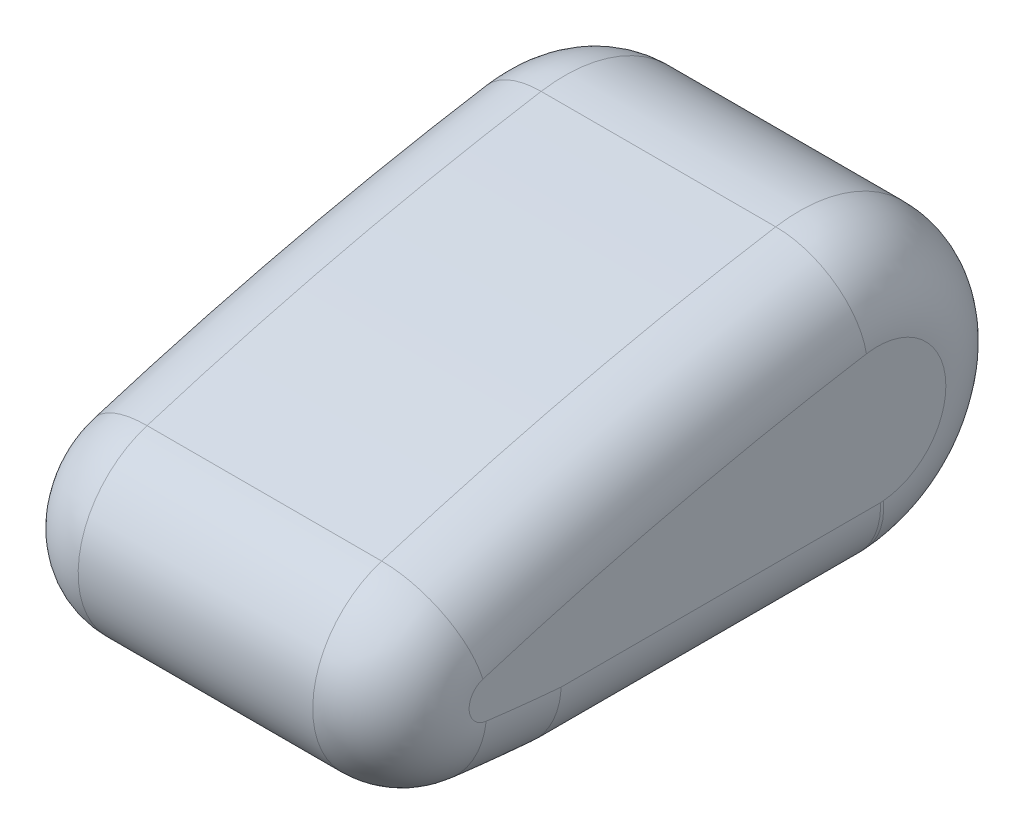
ISO-10303-21;
HEADER;
FILE_DESCRIPTION(('STEP AP214'),'2;1');
FILE_NAME('part.step','',(''),(''),'','','');
FILE_SCHEMA(('AUTOMOTIVE_DESIGN { 1 0 10303 214 1 1 1 1 }'));
ENDSEC;
DATA;
#1=APPLICATION_CONTEXT('core data for automotive mechanical design processes');
#2=APPLICATION_PROTOCOL_DEFINITION('international standard','automotive_design',2000,#1);
#3=PRODUCT_CONTEXT('',#1,'mechanical');
#4=PRODUCT('Part','Part','',(#3));
#5=PRODUCT_RELATED_PRODUCT_CATEGORY('part','',(#4));
#6=PRODUCT_DEFINITION_FORMATION('','',#4);
#7=PRODUCT_DEFINITION_CONTEXT('part definition',#1,'design');
#8=PRODUCT_DEFINITION('design','',#6,#7);
#9=PRODUCT_DEFINITION_SHAPE('','',#8);
#10=(LENGTH_UNIT() NAMED_UNIT(*) SI_UNIT(.MILLI.,.METRE.));
#11=(NAMED_UNIT(*) PLANE_ANGLE_UNIT() SI_UNIT($,.RADIAN.));
#12=(NAMED_UNIT(*) SI_UNIT($,.STERADIAN.) SOLID_ANGLE_UNIT());
#13=UNCERTAINTY_MEASURE_WITH_UNIT(LENGTH_MEASURE(1.E-05),#10,'distance_accuracy_value','');
#14=(GEOMETRIC_REPRESENTATION_CONTEXT(3) GLOBAL_UNCERTAINTY_ASSIGNED_CONTEXT((#13)) GLOBAL_UNIT_ASSIGNED_CONTEXT((#10,
#11,#12)) REPRESENTATION_CONTEXT('',''));
#15=CARTESIAN_POINT('',(0.,0.,0.));
#16=DIRECTION('',(0.,0.,1.));
#17=DIRECTION('',(1.,0.,0.));
#18=AXIS2_PLACEMENT_3D('',#15,#16,#17);
#19=CARTESIAN_POINT('',(-63.5,-1937.01800195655,-32.1917739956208));
#20=DIRECTION('',(-1.,0.,0.));
#21=DIRECTION('',(0.,0.,-1.));
#22=AXIS2_PLACEMENT_3D('',#19,#20,#21);
#23=CYLINDRICAL_SURFACE('',#22,762.);
#24=DIRECTION('',(-1.,0.,0.));
#25=VECTOR('',#24,1.);
#26=CARTESIAN_POINT('',(-63.5,-1184.90959196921,90.1885333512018));
#27=LINE('',#26,#25);
#28=CARTESIAN_POINT('',(-83.82,-1184.90959196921,90.1885333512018));
#29=VERTEX_POINT('',#28);
#30=CARTESIAN_POINT('',(-144.78,-1184.90959196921,90.1885333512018));
#31=VERTEX_POINT('',#30);
#32=EDGE_CURVE('E161',#29,#31,#27,.T.);
#33=ORIENTED_EDGE('',*,*,#32,.T.);
#34=CARTESIAN_POINT('',(-144.78,-1937.01800195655,-32.1917739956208));
#35=DIRECTION('',(-1.,0.,0.));
#36=DIRECTION('',(0.,0.,1.));
#37=AXIS2_PLACEMENT_3D('',#34,#35,#36);
#38=CIRCLE('',#37,762.);
#39=CARTESIAN_POINT('',(-144.78,-1208.92940757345,192.599237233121));
#40=VERTEX_POINT('',#39);
#41=EDGE_CURVE('E42',#40,#31,#38,.T.);
#42=ORIENTED_EDGE('',*,*,#41,.F.);
#43=DIRECTION('',(-1.,0.,0.));
#44=VECTOR('',#43,1.);
#45=CARTESIAN_POINT('',(-63.5,-1208.92940757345,192.599237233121));
#46=LINE('',#45,#44);
#47=CARTESIAN_POINT('',(-83.82,-1208.92940757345,192.599237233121));
#48=VERTEX_POINT('',#47);
#49=EDGE_CURVE('E169',#48,#40,#46,.T.);
#50=ORIENTED_EDGE('',*,*,#49,.F.);
#51=CARTESIAN_POINT('',(-83.82,-1937.01800195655,-32.1917739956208));
#52=DIRECTION('',(-1.,0.,0.));
#53=DIRECTION('',(0.,0.,1.));
#54=AXIS2_PLACEMENT_3D('',#51,#52,#53);
#55=CIRCLE('',#54,762.);
#56=EDGE_CURVE('E11',#29,#48,#55,.F.);
#57=ORIENTED_EDGE('',*,*,#56,.F.);
#58=EDGE_LOOP('',(#33,#42,#50,#57));
#59=FACE_BOUND('',#58,.T.);
#60=ADVANCED_FACE('F33',(#59),#23,.T.);
#61=CARTESIAN_POINT('',(-63.5,-1222.51501246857,84.0695179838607));
#62=DIRECTION('',(-1.,0.,0.));
#63=DIRECTION('',(0.,0.,-1.));
#64=AXIS2_PLACEMENT_3D('',#61,#62,#63);
#65=CYLINDRICAL_SURFACE('',#64,38.0999999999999);
#66=DIRECTION('',(-1.,0.,0.));
#67=VECTOR('',#66,1.);
#68=CARTESIAN_POINT('',(-63.5,-1260.4716735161,80.7677181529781));
#69=LINE('',#68,#67);
#70=CARTESIAN_POINT('',(-83.82,-1260.4716735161,80.7677181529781));
#71=VERTEX_POINT('',#70);
#72=CARTESIAN_POINT('',(-144.78,-1260.4716735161,80.7677181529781));
#73=VERTEX_POINT('',#72);
#74=EDGE_CURVE('E152',#71,#73,#69,.T.);
#75=ORIENTED_EDGE('',*,*,#74,.T.);
#76=CARTESIAN_POINT('',(-144.78,-1222.51501246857,84.0695179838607));
#77=DIRECTION('',(-1.,0.,0.));
#78=DIRECTION('',(0.,0.,1.));
#79=AXIS2_PLACEMENT_3D('',#76,#77,#78);
#80=CIRCLE('',#79,38.0999999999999);
#81=EDGE_CURVE('E188',#31,#73,#80,.T.);
#82=ORIENTED_EDGE('',*,*,#81,.F.);
#83=ORIENTED_EDGE('',*,*,#32,.F.);
#84=CARTESIAN_POINT('',(-83.82,-1222.51501246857,84.0695179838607));
#85=DIRECTION('',(-1.,0.,0.));
#86=DIRECTION('',(0.,0.,1.));
#87=AXIS2_PLACEMENT_3D('',#84,#85,#86);
#88=CIRCLE('',#87,38.0999999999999);
#89=EDGE_CURVE('E190',#71,#29,#88,.F.);
#90=ORIENTED_EDGE('',*,*,#89,.F.);
#91=EDGE_LOOP('',(#75,#82,#83,#90));
#92=FACE_BOUND('',#91,.T.);
#93=ADVANCED_FACE('F236',(#92),#65,.T.);
#94=CARTESIAN_POINT('',(-63.5,-754.382859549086,124.791715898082));
#95=DIRECTION('',(-1.,0.,0.));
#96=DIRECTION('',(0.,0.,-1.));
#97=AXIS2_PLACEMENT_3D('',#94,#95,#96);
#98=CYLINDRICAL_SURFACE('',#97,508.);
#99=DIRECTION('',(-1.,0.,0.));
#100=VECTOR('',#99,1.);
#101=CARTESIAN_POINT('',(-63.5,-1260.61501246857,82.4477983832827));
#102=LINE('',#101,#100);
#103=CARTESIAN_POINT('',(-83.82,-1260.61501246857,82.4477983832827));
#104=VERTEX_POINT('',#103);
#105=CARTESIAN_POINT('',(-144.78,-1260.61501246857,82.4477983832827));
#106=VERTEX_POINT('',#105);
#107=EDGE_CURVE('E150',#104,#106,#102,.T.);
#108=ORIENTED_EDGE('',*,*,#107,.T.);
#109=CARTESIAN_POINT('',(-144.78,-754.382859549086,124.791715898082));
#110=DIRECTION('',(-1.,0.,0.));
#111=DIRECTION('',(0.,0.,1.));
#112=AXIS2_PLACEMENT_3D('',#109,#110,#111);
#113=CIRCLE('',#112,508.);
#114=EDGE_CURVE('E154',#73,#106,#113,.T.);
#115=ORIENTED_EDGE('',*,*,#114,.F.);
#116=ORIENTED_EDGE('',*,*,#74,.F.);
#117=CARTESIAN_POINT('',(-83.82,-754.382859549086,124.791715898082));
#118=DIRECTION('',(-1.,0.,0.));
#119=DIRECTION('',(0.,0.,1.));
#120=AXIS2_PLACEMENT_3D('',#117,#118,#119);
#121=CIRCLE('',#120,508.);
#122=EDGE_CURVE('E124',#104,#71,#121,.F.);
#123=ORIENTED_EDGE('',*,*,#122,.F.);
#124=EDGE_LOOP('',(#108,#115,#116,#123));
#125=FACE_BOUND('',#124,.T.);
#126=ADVANCED_FACE('F148',(#125),#98,.T.);
#127=CARTESIAN_POINT('',(-63.5,-1260.61501246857,167.135633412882));
#128=DIRECTION('',(0.,-1.,0.));
#129=DIRECTION('',(0.,0.,-1.));
#130=AXIS2_PLACEMENT_3D('',#127,#128,#129);
#131=PLANE('',#130);
#132=ORIENTED_EDGE('',*,*,#107,.F.);
#133=DIRECTION('',(0.,0.,-1.));
#134=VECTOR('',#133,1.);
#135=CARTESIAN_POINT('',(-83.82,-1260.61501246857,167.135633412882));
#136=LINE('',#135,#134);
#137=CARTESIAN_POINT('',(-83.82,-1260.61501246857,167.135633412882));
#138=VERTEX_POINT('',#137);
#139=EDGE_CURVE('E135',#138,#104,#136,.T.);
#140=ORIENTED_EDGE('',*,*,#139,.F.);
#141=DIRECTION('',(-1.,0.,0.));
#142=VECTOR('',#141,1.);
#143=CARTESIAN_POINT('',(-63.5,-1260.61501246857,167.135633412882));
#144=LINE('',#143,#142);
#145=CARTESIAN_POINT('',(-144.78,-1260.61501246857,167.135633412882));
#146=VERTEX_POINT('',#145);
#147=EDGE_CURVE('E159',#138,#146,#144,.T.);
#148=ORIENTED_EDGE('',*,*,#147,.T.);
#149=CARTESIAN_POINT('',(-144.78,-1260.61501246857,82.4477983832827));
#150=CARTESIAN_POINT('',(-144.885954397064,-1260.61501246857,82.4474811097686));
#151=CARTESIAN_POINT('',(-144.991468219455,-1260.61501246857,82.4577264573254));
#152=CARTESIAN_POINT('',(-145.197732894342,-1260.61501246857,82.4963266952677));
#153=CARTESIAN_POINT('',(-145.298528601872,-1260.61501246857,82.5244372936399));
#154=CARTESIAN_POINT('',(-145.523684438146,-1260.61501246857,82.6065581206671));
#155=CARTESIAN_POINT('',(-145.646097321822,-1260.61501246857,82.6657946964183));
#156=CARTESIAN_POINT('',(-145.880525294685,-1260.61501246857,82.8029243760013));
#157=CARTESIAN_POINT('',(-145.992473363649,-1260.61501246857,82.8809276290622));
#158=CARTESIAN_POINT('',(-146.289943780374,-1260.61501246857,83.1158598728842));
#159=CARTESIAN_POINT('',(-146.464303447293,-1260.61501246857,83.2867064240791));
#160=CARTESIAN_POINT('',(-146.788207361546,-1260.61501246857,83.6499750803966));
#161=CARTESIAN_POINT('',(-146.937694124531,-1260.61501246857,83.842445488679));
#162=CARTESIAN_POINT('',(-147.189513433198,-1260.61501246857,84.1997213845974));
#163=CARTESIAN_POINT('',(-147.295245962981,-1260.61501246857,84.3621664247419));
#164=CARTESIAN_POINT('',(-147.497210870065,-1260.61501246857,84.6928954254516));
#165=CARTESIAN_POINT('',(-147.593439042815,-1260.61501246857,84.8611819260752));
#166=CARTESIAN_POINT('',(-147.870832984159,-1260.61501246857,85.3729365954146));
#167=CARTESIAN_POINT('',(-148.0403182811,-1260.61501246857,85.7227143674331));
#168=CARTESIAN_POINT('',(-148.357991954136,-1260.61501246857,86.4339216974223));
#169=CARTESIAN_POINT('',(-148.506053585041,-1260.61501246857,86.7954062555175));
#170=CARTESIAN_POINT('',(-148.715242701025,-1260.61501246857,87.3422552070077));
#171=CARTESIAN_POINT('',(-148.782785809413,-1260.61501246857,87.525199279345));
#172=CARTESIAN_POINT('',(-148.914074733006,-1260.61501246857,87.8924398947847));
#173=CARTESIAN_POINT('',(-148.977820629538,-1260.61501246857,88.0767364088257));
#174=CARTESIAN_POINT('',(-149.175652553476,-1260.61501246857,88.6660292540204));
#175=CARTESIAN_POINT('',(-149.303358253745,-1260.61501246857,89.0731727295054));
#176=CARTESIAN_POINT('',(-149.545809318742,-1260.61501246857,89.891323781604));
#177=CARTESIAN_POINT('',(-149.660552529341,-1260.61501246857,90.3023319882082));
#178=CARTESIAN_POINT('',(-149.879305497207,-1260.61501246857,91.1274166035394));
#179=CARTESIAN_POINT('',(-149.983309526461,-1260.61501246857,91.5414945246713));
#180=CARTESIAN_POINT('',(-150.182119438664,-1260.61501246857,92.3718606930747));
#181=CARTESIAN_POINT('',(-150.276924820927,-1260.61501246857,92.7881490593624));
#182=CARTESIAN_POINT('',(-150.549871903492,-1260.61501246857,94.0416040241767));
#183=CARTESIAN_POINT('',(-150.716035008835,-1260.61501246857,94.8813854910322));
#184=CARTESIAN_POINT('',(-151.023282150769,-1260.61501246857,96.565174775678));
#185=CARTESIAN_POINT('',(-151.164373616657,-1260.61501246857,97.4091812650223));
#186=CARTESIAN_POINT('',(-151.425918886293,-1260.61501246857,99.1004061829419));
#187=CARTESIAN_POINT('',(-151.54637171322,-1260.61501246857,99.9476247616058));
#188=CARTESIAN_POINT('',(-151.769703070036,-1260.61501246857,101.644415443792));
#189=CARTESIAN_POINT('',(-151.872580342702,-1260.61501246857,102.493987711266));
#190=CARTESIAN_POINT('',(-152.062824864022,-1260.61501246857,104.193706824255));
#191=CARTESIAN_POINT('',(-152.150212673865,-1260.61501246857,105.043851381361));
#192=CARTESIAN_POINT('',(-152.311259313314,-1260.61501246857,106.745445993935));
#193=CARTESIAN_POINT('',(-152.384917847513,-1260.61501246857,107.596896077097));
#194=CARTESIAN_POINT('',(-152.578998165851,-1260.61501246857,110.049184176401));
#195=CARTESIAN_POINT('',(-152.68365912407,-1260.61501246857,111.651283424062));
#196=CARTESIAN_POINT('',(-152.854506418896,-1260.61501246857,114.858003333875));
#197=CARTESIAN_POINT('',(-152.920680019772,-1260.61501246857,116.462624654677));
#198=CARTESIAN_POINT('',(-153.017416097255,-1260.61501246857,119.670058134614));
#199=CARTESIAN_POINT('',(-153.048042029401,-1260.61501246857,121.272868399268));
#200=CARTESIAN_POINT('',(-153.075229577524,-1260.61501246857,124.478809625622));
#201=CARTESIAN_POINT('',(-153.071790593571,-1260.61501246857,126.081940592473));
#202=CARTESIAN_POINT('',(-153.037224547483,-1260.61501246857,128.77642186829));
#203=CARTESIAN_POINT('',(-153.015279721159,-1260.61501246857,129.867897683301));
#204=CARTESIAN_POINT('',(-152.955045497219,-1260.61501246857,132.050395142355));
#205=CARTESIAN_POINT('',(-152.916756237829,-1260.61501246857,133.141416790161));
#206=CARTESIAN_POINT('',(-152.823033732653,-1260.61501246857,135.323071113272));
#207=CARTESIAN_POINT('',(-152.767595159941,-1260.61501246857,136.413703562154));
#208=CARTESIAN_POINT('',(-152.63833520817,-1260.61501246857,138.59385207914));
#209=CARTESIAN_POINT('',(-152.564514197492,-1260.61501246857,139.683368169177));
#210=CARTESIAN_POINT('',(-152.366358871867,-1260.61501246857,142.255794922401));
#211=CARTESIAN_POINT('',(-152.233414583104,-1260.61501246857,143.738068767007));
#212=CARTESIAN_POINT('',(-152.000832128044,-1260.61501246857,145.957911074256));
#213=CARTESIAN_POINT('',(-151.917780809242,-1260.61501246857,146.69723536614));
#214=CARTESIAN_POINT('',(-151.73930894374,-1260.61501246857,148.174385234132));
#215=CARTESIAN_POINT('',(-151.643888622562,-1260.61501246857,148.912210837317));
#216=CARTESIAN_POINT('',(-151.401449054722,-1260.61501246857,150.656611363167));
#217=CARTESIAN_POINT('',(-151.24835100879,-1260.61501246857,151.662352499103));
#218=CARTESIAN_POINT('',(-150.910156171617,-1260.61501246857,153.668437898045));
#219=CARTESIAN_POINT('',(-150.725063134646,-1260.61501246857,154.668782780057));
#220=CARTESIAN_POINT('',(-150.377600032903,-1260.61501246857,156.349130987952));
#221=CARTESIAN_POINT('',(-150.226249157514,-1260.61501246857,157.031404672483));
#222=CARTESIAN_POINT('',(-149.898792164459,-1260.61501246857,158.390224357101));
#223=CARTESIAN_POINT('',(-149.722682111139,-1260.61501246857,159.06676942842));
#224=CARTESIAN_POINT('',(-149.396945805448,-1260.61501246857,160.203817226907));
#225=CARTESIAN_POINT('',(-149.255840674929,-1260.61501246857,160.666750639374));
#226=CARTESIAN_POINT('',(-148.953827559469,-1260.61501246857,161.585804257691));
#227=CARTESIAN_POINT('',(-148.792936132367,-1260.61501246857,162.041929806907));
#228=CARTESIAN_POINT('',(-148.497014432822,-1260.61501246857,162.808412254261));
#229=CARTESIAN_POINT('',(-148.368755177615,-1260.61501246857,163.121359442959));
#230=CARTESIAN_POINT('',(-148.095390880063,-1260.61501246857,163.740613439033));
#231=CARTESIAN_POINT('',(-147.950251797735,-1260.61501246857,164.046905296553));
#232=CARTESIAN_POINT('',(-147.625374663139,-1260.61501246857,164.672683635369));
#233=CARTESIAN_POINT('',(-147.443793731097,-1260.61501246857,164.991253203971));
#234=CARTESIAN_POINT('',(-147.143763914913,-1260.61501246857,165.450528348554));
#235=CARTESIAN_POINT('',(-147.039307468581,-1260.61501246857,165.60032943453));
#236=CARTESIAN_POINT('',(-146.818873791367,-1260.61501246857,165.891120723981));
#237=CARTESIAN_POINT('',(-146.702909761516,-1260.61501246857,166.032120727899));
#238=CARTESIAN_POINT('',(-146.481470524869,-1260.61501246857,166.273820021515));
#239=CARTESIAN_POINT('',(-146.378620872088,-1260.61501246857,166.37690095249));
#240=CARTESIAN_POINT('',(-146.161874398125,-1260.61501246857,166.57114054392));
#241=CARTESIAN_POINT('',(-146.047972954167,-1260.61501246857,166.662294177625));
#242=CARTESIAN_POINT('',(-145.825131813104,-1260.61501246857,166.814949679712));
#243=CARTESIAN_POINT('',(-145.717851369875,-1260.61501246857,166.878832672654));
#244=CARTESIAN_POINT('',(-145.49456748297,-1260.61501246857,166.98828742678));
#245=CARTESIAN_POINT('',(-145.378605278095,-1260.61501246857,167.033939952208));
#246=CARTESIAN_POINT('',(-145.181687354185,-1260.61501246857,167.089750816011));
#247=CARTESIAN_POINT('',(-145.102664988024,-1260.61501246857,167.106738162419));
#248=CARTESIAN_POINT('',(-144.942484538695,-1260.61501246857,167.129779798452));
#249=CARTESIAN_POINT('',(-144.861315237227,-1260.61501246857,167.135755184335));
#250=CARTESIAN_POINT('',(-144.78,-1260.61501246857,167.135633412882));
#251=B_SPLINE_CURVE_WITH_KNOTS('',3,(#149,#150,#151,#152,#153,#154,#155,#156,#157,#158,#159,
#160,#161,#162,#163,#164,#165,#166,#167,#168,#169,#170,#171,#172,#173,#174,#175,#176,#177,#178,
#179,#180,#181,#182,#183,#184,#185,#186,#187,#188,#189,#190,#191,#192,#193,#194,#195,#196,#197,
#198,#199,#200,#201,#202,#203,#204,#205,#206,#207,#208,#209,#210,#211,#212,#213,#214,#215,#216,
#217,#218,#219,#220,#221,#222,#223,#224,#225,#226,#227,#228,#229,#230,#231,#232,#233,#234,#235,
#236,#237,#238,#239,#240,#241,#242,#243,#244,#245,#246,#247,#248,#249,#250),.UNSPECIFIED.,.F.,
.F.,(4,2,2,2,2,2,2,2,2,2,2,2,2,2,2,2,2,2,2,2,2,2,2,2,2,2,2,2,2,2,2,2,2,2,2,2,2,2,2,2,2,2,2,2,2,
2,2,2,2,2,4),(0.,0.316659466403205,0.629079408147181,1.0347575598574,1.44287752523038,
2.17110503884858,2.90099287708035,3.48206624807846,4.06339553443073,5.2281553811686,
6.39954664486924,6.98455258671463,7.56954599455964,8.84934577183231,10.1293579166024,
11.4100492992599,12.6908103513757,15.258446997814,17.8253215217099,20.3923175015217,
22.9594970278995,25.5232428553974,28.0870438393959,32.9030033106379,37.7205555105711,
42.529494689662,47.3385185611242,50.6134985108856,53.8884507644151,57.1644213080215,
60.4403262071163,64.9043505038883,67.1361907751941,69.3679903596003,72.4195779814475,
75.4708077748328,77.5670648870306,79.6636555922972,81.1152223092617,82.5655824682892,
83.5798278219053,84.5961551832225,85.6941343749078,86.241614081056,86.7884728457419,
87.2246783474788,87.6610670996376,88.0344299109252,88.4061198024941,88.6478773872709,
88.8913605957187),.UNSPECIFIED.);
#252=EDGE_CURVE('E142',#106,#146,#251,.T.);
#253=ORIENTED_EDGE('',*,*,#252,.F.);
#254=EDGE_LOOP('',(#132,#140,#148,#253));
#255=FACE_BOUND('',#254,.T.);
#256=ADVANCED_FACE('F156',(#255),#131,.T.);
#257=CARTESIAN_POINT('',(-63.5,-754.382859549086,124.791715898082));
#258=DIRECTION('',(-1.,0.,0.));
#259=DIRECTION('',(0.,0.,-1.));
#260=AXIS2_PLACEMENT_3D('',#257,#258,#259);
#261=CYLINDRICAL_SURFACE('',#260,508.);
#262=DIRECTION('',(-1.,0.,0.));
#263=VECTOR('',#262,1.);
#264=CARTESIAN_POINT('',(-63.5,-1258.39987832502,188.280650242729));
#265=LINE('',#264,#263);
#266=CARTESIAN_POINT('',(-83.82,-1258.39987832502,188.280650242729));
#267=VERTEX_POINT('',#266);
#268=CARTESIAN_POINT('',(-144.78,-1258.39987832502,188.280650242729));
#269=VERTEX_POINT('',#268);
#270=EDGE_CURVE('E163',#267,#269,#265,.T.);
#271=ORIENTED_EDGE('',*,*,#270,.T.);
#272=CARTESIAN_POINT('',(-144.78,-754.382859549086,124.791715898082));
#273=DIRECTION('',(-1.,0.,0.));
#274=DIRECTION('',(0.,0.,1.));
#275=AXIS2_PLACEMENT_3D('',#272,#273,#274);
#276=CIRCLE('',#275,508.);
#277=EDGE_CURVE('E193',#146,#269,#276,.T.);
#278=ORIENTED_EDGE('',*,*,#277,.F.);
#279=ORIENTED_EDGE('',*,*,#147,.F.);
#280=CARTESIAN_POINT('',(-83.82,-754.382859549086,124.791715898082));
#281=DIRECTION('',(-1.,0.,0.));
#282=DIRECTION('',(0.,0.,1.));
#283=AXIS2_PLACEMENT_3D('',#280,#281,#282);
#284=CIRCLE('',#283,508.);
#285=EDGE_CURVE('E195',#267,#138,#284,.F.);
#286=ORIENTED_EDGE('',*,*,#285,.F.);
#287=EDGE_LOOP('',(#271,#278,#279,#286));
#288=FACE_BOUND('',#287,.T.);
#289=ADVANCED_FACE('F224',(#288),#261,.T.);
#290=CARTESIAN_POINT('',(-63.5,-1233.19902738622,185.106203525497));
#291=DIRECTION('',(-1.,0.,0.));
#292=DIRECTION('',(0.,0.,-1.));
#293=AXIS2_PLACEMENT_3D('',#290,#291,#292);
#294=CYLINDRICAL_SURFACE('',#293,25.4);
#295=ORIENTED_EDGE('',*,*,#49,.T.);
#296=CARTESIAN_POINT('',(-144.78,-1233.19902738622,185.106203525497));
#297=DIRECTION('',(-1.,0.,0.));
#298=DIRECTION('',(0.,0.,1.));
#299=AXIS2_PLACEMENT_3D('',#296,#297,#298);
#300=CIRCLE('',#299,25.4);
#301=EDGE_CURVE('E197',#269,#40,#300,.T.);
#302=ORIENTED_EDGE('',*,*,#301,.F.);
#303=ORIENTED_EDGE('',*,*,#270,.F.);
#304=CARTESIAN_POINT('',(-83.82,-1233.19902738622,185.106203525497));
#305=DIRECTION('',(-1.,0.,0.));
#306=DIRECTION('',(0.,0.,1.));
#307=AXIS2_PLACEMENT_3D('',#304,#305,#306);
#308=CIRCLE('',#307,25.4);
#309=EDGE_CURVE('E200',#48,#267,#308,.F.);
#310=ORIENTED_EDGE('',*,*,#309,.F.);
#311=EDGE_LOOP('',(#295,#302,#303,#310));
#312=FACE_BOUND('',#311,.T.);
#313=ADVANCED_FACE('F228',(#312),#294,.T.);
#314=CARTESIAN_POINT('',(-63.5,-1937.01800195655,-32.1917739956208));
#315=DIRECTION('',(1.,0.,0.));
#316=DIRECTION('',(0.,0.,1.));
#317=AXIS2_PLACEMENT_3D('',#314,#315,#316);
#318=PLANE('',#317);
#319=CARTESIAN_POINT('',(-63.5,-1233.19902738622,185.106203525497));
#320=DIRECTION('',(-1.,0.,0.));
#321=DIRECTION('',(0.,0.,1.));
#322=AXIS2_PLACEMENT_3D('',#319,#320,#321);
#323=CIRCLE('',#322,5.07999999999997);
#324=CARTESIAN_POINT('',(-63.5,-1238.23919757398,185.741092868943));
#325=VERTEX_POINT('',#324);
#326=CARTESIAN_POINT('',(-63.5,-1228.34510342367,186.604810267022));
#327=VERTEX_POINT('',#326);
#328=EDGE_CURVE('E179',#325,#327,#323,.T.);
#329=ORIENTED_EDGE('',*,*,#328,.F.);
#330=CARTESIAN_POINT('',(-63.5,-754.382859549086,124.791715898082));
#331=DIRECTION('',(-1.,0.,0.));
#332=DIRECTION('',(0.,0.,1.));
#333=AXIS2_PLACEMENT_3D('',#330,#331,#332);
#334=CIRCLE('',#333,487.68);
#335=CARTESIAN_POINT('',(-63.5,-1240.29501246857,166.278605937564));
#336=VERTEX_POINT('',#335);
#337=EDGE_CURVE('E175',#336,#325,#334,.T.);
#338=ORIENTED_EDGE('',*,*,#337,.F.);
#339=DIRECTION('',(0.,0.,-1.));
#340=VECTOR('',#339,1.);
#341=CARTESIAN_POINT('',(-63.5,-1240.29501246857,-32.1917739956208));
#342=LINE('',#341,#340);
#343=CARTESIAN_POINT('',(-63.5,-1240.29501246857,83.3048258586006));
#344=VERTEX_POINT('',#343);
#345=EDGE_CURVE('E153',#344,#336,#342,.F.);
#346=ORIENTED_EDGE('',*,*,#345,.F.);
#347=CARTESIAN_POINT('',(-63.5,-754.382859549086,124.791715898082));
#348=DIRECTION('',(-1.,0.,0.));
#349=DIRECTION('',(0.,0.,1.));
#350=AXIS2_PLACEMENT_3D('',#347,#348,#349);
#351=CIRCLE('',#350,487.68);
#352=CARTESIAN_POINT('',(-63.5,-1240.22812095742,82.5286780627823));
#353=VERTEX_POINT('',#352);
#354=EDGE_CURVE('E127',#353,#344,#351,.T.);
#355=ORIENTED_EDGE('',*,*,#354,.F.);
#356=CARTESIAN_POINT('',(-63.5,-1222.51501246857,84.0695179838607));
#357=DIRECTION('',(-1.,0.,0.));
#358=DIRECTION('',(0.,0.,1.));
#359=AXIS2_PLACEMENT_3D('',#356,#357,#358);
#360=CIRCLE('',#359,17.7799999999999);
#361=CARTESIAN_POINT('',(-63.5,-1204.96581623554,86.9250584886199));
#362=VERTEX_POINT('',#361);
#363=EDGE_CURVE('E182',#362,#353,#360,.T.);
#364=ORIENTED_EDGE('',*,*,#363,.F.);
#365=CARTESIAN_POINT('',(-63.5,-1937.01800195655,-32.1917739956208));
#366=DIRECTION('',(-1.,0.,0.));
#367=DIRECTION('',(0.,0.,1.));
#368=AXIS2_PLACEMENT_3D('',#365,#366,#367);
#369=CIRCLE('',#368,741.68);
#370=EDGE_CURVE('E185',#327,#362,#369,.T.);
#371=ORIENTED_EDGE('',*,*,#370,.F.);
#372=EDGE_LOOP('',(#329,#338,#346,#355,#364,#371));
#373=FACE_BOUND('',#372,.T.);
#374=ADVANCED_FACE('F232',(#373),#318,.T.);
#375=CARTESIAN_POINT('',(-165.1,-1937.01800195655,-32.1917739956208));
#376=DIRECTION('',(1.,0.,0.));
#377=DIRECTION('',(0.,0.,1.));
#378=AXIS2_PLACEMENT_3D('',#375,#376,#377);
#379=PLANE('',#378);
#380=CARTESIAN_POINT('',(-165.1,-754.382859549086,124.791715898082));
#381=DIRECTION('',(-1.,0.,0.));
#382=DIRECTION('',(0.,0.,1.));
#383=AXIS2_PLACEMENT_3D('',#380,#381,#382);
#384=CIRCLE('',#383,487.68);
#385=CARTESIAN_POINT('',(-165.1,-1238.23919757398,185.741092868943));
#386=VERTEX_POINT('',#385);
#387=CARTESIAN_POINT('',(-165.1,-1240.22812095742,82.5286780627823));
#388=VERTEX_POINT('',#387);
#389=EDGE_CURVE('E208',#386,#388,#384,.F.);
#390=ORIENTED_EDGE('',*,*,#389,.F.);
#391=CARTESIAN_POINT('',(-165.1,-1233.19902738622,185.106203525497));
#392=DIRECTION('',(-1.,0.,0.));
#393=DIRECTION('',(0.,0.,1.));
#394=AXIS2_PLACEMENT_3D('',#391,#392,#393);
#395=CIRCLE('',#394,5.07999999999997);
#396=CARTESIAN_POINT('',(-165.1,-1228.34510342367,186.604810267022));
#397=VERTEX_POINT('',#396);
#398=EDGE_CURVE('E206',#397,#386,#395,.F.);
#399=ORIENTED_EDGE('',*,*,#398,.F.);
#400=CARTESIAN_POINT('',(-165.1,-1937.01800195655,-32.1917739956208));
#401=DIRECTION('',(-1.,0.,0.));
#402=DIRECTION('',(0.,0.,1.));
#403=AXIS2_PLACEMENT_3D('',#400,#401,#402);
#404=CIRCLE('',#403,741.68);
#405=CARTESIAN_POINT('',(-165.1,-1204.96581623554,86.9250584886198));
#406=VERTEX_POINT('',#405);
#407=EDGE_CURVE('E203',#406,#397,#404,.F.);
#408=ORIENTED_EDGE('',*,*,#407,.F.);
#409=CARTESIAN_POINT('',(-165.1,-1222.51501246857,84.0695179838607));
#410=DIRECTION('',(-1.,0.,0.));
#411=DIRECTION('',(0.,0.,1.));
#412=AXIS2_PLACEMENT_3D('',#409,#410,#411);
#413=CIRCLE('',#412,17.7799999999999);
#414=EDGE_CURVE('E143',#388,#406,#413,.F.);
#415=ORIENTED_EDGE('',*,*,#414,.F.);
#416=EDGE_LOOP('',(#390,#399,#408,#415));
#417=FACE_BOUND('',#416,.T.);
#418=ADVANCED_FACE('F268',(#417),#379,.F.);
#419=CARTESIAN_POINT('',(-83.82,-1233.19902738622,185.106203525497));
#420=DIRECTION('',(1.,0.,0.));
#421=DIRECTION('',(0.,0.,1.));
#422=AXIS2_PLACEMENT_3D('',#419,#420,#421);
#423=DEGENERATE_TOROIDAL_SURFACE('',#422,5.07999999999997,20.32,.T.);
#424=CARTESIAN_POINT('',(-83.82,-1228.34510342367,186.604810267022));
#425=DIRECTION('',(0.,-0.295001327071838,0.955496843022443));
#426=DIRECTION('',(0.,0.955496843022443,0.295001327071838));
#427=AXIS2_PLACEMENT_3D('',#424,#425,#426);
#428=CIRCLE('',#427,20.32);
#429=EDGE_CURVE('E255',#327,#48,#428,.T.);
#430=ORIENTED_EDGE('',*,*,#429,.T.);
#431=ORIENTED_EDGE('',*,*,#309,.T.);
#432=CARTESIAN_POINT('',(-83.82,-1238.23919757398,185.741092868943));
#433=DIRECTION('',(0.,0.124978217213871,0.992159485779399));
#434=DIRECTION('',(0.,0.9921594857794,-0.124978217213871));
#435=AXIS2_PLACEMENT_3D('',#432,#433,#434);
#436=CIRCLE('',#435,20.32);
#437=EDGE_CURVE('E172',#267,#325,#436,.T.);
#438=ORIENTED_EDGE('',*,*,#437,.T.);
#439=ORIENTED_EDGE('',*,*,#328,.T.);
#440=EDGE_LOOP('',(#430,#431,#438,#439));
#441=FACE_BOUND('',#440,.T.);
#442=ADVANCED_FACE('F262',(#441),#423,.T.);
#443=CARTESIAN_POINT('',(-83.82,-754.382859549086,124.791715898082));
#444=DIRECTION('',(1.,0.,0.));
#445=DIRECTION('',(0.,0.,1.));
#446=AXIS2_PLACEMENT_3D('',#443,#444,#445);
#447=TOROIDAL_SURFACE('',#446,487.68,20.32);
#448=ORIENTED_EDGE('',*,*,#437,.F.);
#449=ORIENTED_EDGE('',*,*,#285,.T.);
#450=CARTESIAN_POINT('',(-83.82,-1260.61501246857,167.135633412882));
#451=CARTESIAN_POINT('',(-83.5344082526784,-1260.61501283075,167.135633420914));
#452=CARTESIAN_POINT('',(-83.2488482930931,-1260.60899088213,167.135382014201));
#453=CARTESIAN_POINT('',(-82.6782434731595,-1260.58491989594,167.134377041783));
#454=CARTESIAN_POINT('',(-82.3931986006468,-1260.56687114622,167.133623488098));
#455=CARTESIAN_POINT('',(-81.5396414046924,-1260.49472307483,167.130611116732));
#456=CARTESIAN_POINT('',(-80.9725574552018,-1260.4226219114,167.127600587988));
#457=CARTESIAN_POINT('',(-79.8468966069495,-1260.23097442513,167.119597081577));
#458=CARTESIAN_POINT('',(-79.2883139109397,-1260.11146209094,167.114605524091));
#459=CARTESIAN_POINT('',(-78.4596405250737,-1259.8973185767,167.105659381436));
#460=CARTESIAN_POINT('',(-78.1849383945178,-1259.82012100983,167.102434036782));
#461=CARTESIAN_POINT('',(-77.6389627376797,-1259.65421191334,167.095501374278));
#462=CARTESIAN_POINT('',(-77.3676901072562,-1259.56549744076,167.091793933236));
#463=CARTESIAN_POINT('',(-76.5596946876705,-1259.28227381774,167.079956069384));
#464=CARTESIAN_POINT('',(-76.0288621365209,-1259.07070198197,167.07111083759));
#465=CARTESIAN_POINT('',(-74.9869276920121,-1258.60362200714,167.051576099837));
#466=CARTESIAN_POINT('',(-74.4758258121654,-1258.348113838,167.040886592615));
#467=CARTESIAN_POINT('',(-73.7268134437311,-1257.9333655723,167.02352737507));
#468=CARTESIAN_POINT('',(-73.4800673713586,-1257.78985820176,167.01751971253));
#469=CARTESIAN_POINT('',(-72.9929082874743,-1257.49262528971,167.005073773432));
#470=CARTESIAN_POINT('',(-72.7524936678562,-1257.33890237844,166.998635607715));
#471=CARTESIAN_POINT('',(-72.0412587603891,-1256.8627249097,166.978687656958));
#472=CARTESIAN_POINT('',(-71.5803978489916,-1256.52523415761,166.964543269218));
#473=CARTESIAN_POINT('',(-70.6886465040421,-1255.81261290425,166.934660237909));
#474=CARTESIAN_POINT('',(-70.2577663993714,-1255.43746953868,166.918921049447));
#475=CARTESIAN_POINT('',(-69.4291333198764,-1254.65228056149,166.885958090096));
#476=CARTESIAN_POINT('',(-69.0313805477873,-1254.2422347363,166.868734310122));
#477=CARTESIAN_POINT('',(-68.2716699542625,-1253.38996273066,166.83291123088));
#478=CARTESIAN_POINT('',(-67.9097233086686,-1252.94772657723,166.814311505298));
#479=CARTESIAN_POINT('',(-67.395807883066,-1252.26287980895,166.785487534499));
#480=CARTESIAN_POINT('',(-67.229331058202,-1252.03100624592,166.775725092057));
#481=CARTESIAN_POINT('',(-66.9062516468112,-1251.56040173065,166.75590437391));
#482=CARTESIAN_POINT('',(-66.7496516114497,-1251.3216690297,166.745846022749));
#483=CARTESIAN_POINT('',(-66.2948978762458,-1250.59547538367,166.715238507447));
#484=CARTESIAN_POINT('',(-66.0120347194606,-1250.0983443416,166.694270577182));
#485=CARTESIAN_POINT('',(-65.4892339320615,-1249.08204628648,166.65137152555));
#486=CARTESIAN_POINT('',(-65.2492960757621,-1248.56287938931,166.62944040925));
#487=CARTESIAN_POINT('',(-64.9229292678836,-1247.77062038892,166.595945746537));
#488=CARTESIAN_POINT('',(-64.8197414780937,-1247.50431784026,166.584682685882));
#489=CARTESIAN_POINT('',(-64.6247030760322,-1246.96767900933,166.561976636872));
#490=CARTESIAN_POINT('',(-64.5328497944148,-1246.69734369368,166.550533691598));
#491=CARTESIAN_POINT('',(-64.2745422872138,-1245.88098121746,166.515963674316));
#492=CARTESIAN_POINT('',(-64.1252554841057,-1245.32939132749,166.492586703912));
#493=CARTESIAN_POINT('',(-63.9182808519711,-1244.4132518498,166.453726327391));
#494=CARTESIAN_POINT('',(-63.8468812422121,-1244.05170267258,166.438381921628));
#495=CARTESIAN_POINT('',(-63.7238402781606,-1243.32525987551,166.407533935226));
#496=CARTESIAN_POINT('',(-63.6721972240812,-1242.96036654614,166.392030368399));
#497=CARTESIAN_POINT('',(-63.5888895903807,-1242.22889421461,166.360934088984));
#498=CARTESIAN_POINT('',(-63.5571946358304,-1241.86231863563,166.345341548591));
#499=CARTESIAN_POINT('',(-63.5137534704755,-1241.12804554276,166.314091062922));
#500=CARTESIAN_POINT('',(-63.5020021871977,-1240.76034833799,166.298433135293));
#501=CARTESIAN_POINT('',(-63.5000781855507,-1240.36011782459,166.281380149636));
#502=CARTESIAN_POINT('',(-63.4999999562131,-1240.32756485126,166.279993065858));
#503=CARTESIAN_POINT('',(-63.5,-1240.29501246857,166.278605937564));
#504=B_SPLINE_CURVE_WITH_KNOTS('',3,(#450,#451,#452,#453,#454,#455,#456,#457,#458,#459,#460,
#461,#462,#463,#464,#465,#466,#467,#468,#469,#470,#471,#472,#473,#474,#475,#476,#477,#478,#479,
#480,#481,#482,#483,#484,#485,#486,#487,#488,#489,#490,#491,#492,#493,#494,#495,#496,#497,#498,
#499,#500,#501,#502,#503),.UNSPECIFIED.,.F.,.F.,(4,2,2,2,2,2,2,2,2,2,2,2,2,2,2,2,2,2,2,2,2,2,2,
2,2,2,4),(0.,0.856648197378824,1.7132758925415,3.42608559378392,5.13766960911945,
5.99353203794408,6.84961359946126,8.56198603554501,10.2743596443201,11.1306570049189,
11.9867347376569,13.6987206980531,15.4112935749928,17.1238769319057,18.8369931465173,
19.6936163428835,20.5504599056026,22.26536433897,23.9802597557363,24.8374863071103,
25.6945105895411,27.4078917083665,28.5139820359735,29.6199771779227,30.7242841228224,
31.8283101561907,31.9260575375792),.UNSPECIFIED.);
#505=EDGE_CURVE('E137',#138,#336,#504,.T.);
#506=ORIENTED_EDGE('',*,*,#505,.T.);
#507=ORIENTED_EDGE('',*,*,#337,.T.);
#508=EDGE_LOOP('',(#448,#449,#506,#507));
#509=FACE_BOUND('',#508,.T.);
#510=ADVANCED_FACE('F257',(#509),#447,.T.);
#511=CARTESIAN_POINT('',(-83.82,-1937.01800195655,-32.1917739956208));
#512=DIRECTION('',(1.,0.,0.));
#513=DIRECTION('',(0.,0.,1.));
#514=AXIS2_PLACEMENT_3D('',#511,#512,#513);
#515=TOROIDAL_SURFACE('',#514,741.68,20.32);
#516=ORIENTED_EDGE('',*,*,#429,.F.);
#517=ORIENTED_EDGE('',*,*,#370,.T.);
#518=CARTESIAN_POINT('',(-83.82,-1204.96581623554,86.9250584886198));
#519=DIRECTION('',(0.,-0.160604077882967,0.987018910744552));
#520=DIRECTION('',(0.,0.987018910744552,0.160604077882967));
#521=AXIS2_PLACEMENT_3D('',#518,#519,#520);
#522=CIRCLE('',#521,20.32);
#523=EDGE_CURVE('E131',#362,#29,#522,.T.);
#524=ORIENTED_EDGE('',*,*,#523,.T.);
#525=ORIENTED_EDGE('',*,*,#56,.T.);
#526=EDGE_LOOP('',(#516,#517,#524,#525));
#527=FACE_BOUND('',#526,.T.);
#528=ADVANCED_FACE('F261',(#527),#515,.T.);
#529=CARTESIAN_POINT('',(-83.82,-1240.29501246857,167.135633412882));
#530=DIRECTION('',(0.,0.,-1.));
#531=DIRECTION('',(1.,0.,0.));
#532=AXIS2_PLACEMENT_3D('',#529,#530,#531);
#533=CYLINDRICAL_SURFACE('',#532,20.32);
#534=ORIENTED_EDGE('',*,*,#505,.F.);
#535=ORIENTED_EDGE('',*,*,#139,.T.);
#536=CARTESIAN_POINT('',(-83.82,-1260.61501246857,82.4477983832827));
#537=CARTESIAN_POINT('',(-83.5344082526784,-1260.61501283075,82.4477983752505));
#538=CARTESIAN_POINT('',(-83.2488482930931,-1260.60899088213,82.4480497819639));
#539=CARTESIAN_POINT('',(-82.6782434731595,-1260.58491989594,82.4490547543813));
#540=CARTESIAN_POINT('',(-82.3931986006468,-1260.56687114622,82.4498083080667));
#541=CARTESIAN_POINT('',(-81.5396414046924,-1260.49472307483,82.4528206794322));
#542=CARTESIAN_POINT('',(-80.9725574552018,-1260.4226219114,82.4558312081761));
#543=CARTESIAN_POINT('',(-79.8468966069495,-1260.23097442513,82.4638347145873));
#544=CARTESIAN_POINT('',(-79.2883139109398,-1260.11146209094,82.4688262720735));
#545=CARTESIAN_POINT('',(-78.4596405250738,-1259.8973185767,82.4777724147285));
#546=CARTESIAN_POINT('',(-78.1849383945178,-1259.82012100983,82.4809977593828));
#547=CARTESIAN_POINT('',(-77.6389627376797,-1259.65421191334,82.4879304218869));
#548=CARTESIAN_POINT('',(-77.3676901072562,-1259.56549744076,82.4916378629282));
#549=CARTESIAN_POINT('',(-76.5596946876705,-1259.28227381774,82.5034757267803));
#550=CARTESIAN_POINT('',(-76.0288621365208,-1259.07070198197,82.512320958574));
#551=CARTESIAN_POINT('',(-74.986927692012,-1258.60362200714,82.531855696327));
#552=CARTESIAN_POINT('',(-74.4758258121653,-1258.348113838,82.5425452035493));
#553=CARTESIAN_POINT('',(-73.726813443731,-1257.9333655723,82.559904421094));
#554=CARTESIAN_POINT('',(-73.4800673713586,-1257.78985820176,82.5659120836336));
#555=CARTESIAN_POINT('',(-72.9929082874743,-1257.49262528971,82.5783580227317));
#556=CARTESIAN_POINT('',(-72.7524936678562,-1257.33890237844,82.5847961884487));
#557=CARTESIAN_POINT('',(-72.0412587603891,-1256.8627249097,82.6047441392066));
#558=CARTESIAN_POINT('',(-71.5803978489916,-1256.52523415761,82.6188885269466));
#559=CARTESIAN_POINT('',(-70.6886465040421,-1255.81261290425,82.6487715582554));
#560=CARTESIAN_POINT('',(-70.2577663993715,-1255.43746953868,82.6645107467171));
#561=CARTESIAN_POINT('',(-69.4291333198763,-1254.65228056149,82.6974737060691));
#562=CARTESIAN_POINT('',(-69.0313805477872,-1254.2422347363,82.7146974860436));
#563=CARTESIAN_POINT('',(-68.2716699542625,-1253.38996273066,82.7505205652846));
#564=CARTESIAN_POINT('',(-67.9097233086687,-1252.94772657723,82.7691202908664));
#565=CARTESIAN_POINT('',(-67.3958078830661,-1252.26287980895,82.7979442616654));
#566=CARTESIAN_POINT('',(-67.2293310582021,-1252.03100624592,82.8077067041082));
#567=CARTESIAN_POINT('',(-66.9062516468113,-1251.56040173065,82.8275274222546));
#568=CARTESIAN_POINT('',(-66.7496516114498,-1251.3216690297,82.8375857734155));
#569=CARTESIAN_POINT('',(-66.2948978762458,-1250.59547538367,82.8681932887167));
#570=CARTESIAN_POINT('',(-66.0120347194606,-1250.0983443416,82.8891612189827));
#571=CARTESIAN_POINT('',(-65.4892339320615,-1249.08204628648,82.9320602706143));
#572=CARTESIAN_POINT('',(-65.2492960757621,-1248.56287938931,82.9539913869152));
#573=CARTESIAN_POINT('',(-64.9229292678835,-1247.77062038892,82.9874860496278));
#574=CARTESIAN_POINT('',(-64.8197414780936,-1247.50431784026,82.9987491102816));
#575=CARTESIAN_POINT('',(-64.6247030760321,-1246.96767900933,83.0214551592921));
#576=CARTESIAN_POINT('',(-64.5328497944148,-1246.69734369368,83.0328981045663));
#577=CARTESIAN_POINT('',(-64.2745422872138,-1245.88098121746,83.0674681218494));
#578=CARTESIAN_POINT('',(-64.1252554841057,-1245.32939132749,83.0908450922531));
#579=CARTESIAN_POINT('',(-63.9182808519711,-1244.4132518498,83.1297054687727));
#580=CARTESIAN_POINT('',(-63.8468812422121,-1244.05170267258,83.1450498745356));
#581=CARTESIAN_POINT('',(-63.7238402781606,-1243.32525987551,83.1758978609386));
#582=CARTESIAN_POINT('',(-63.6721972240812,-1242.96036654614,83.1914014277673));
#583=CARTESIAN_POINT('',(-63.5888895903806,-1242.22889421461,83.2224977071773));
#584=CARTESIAN_POINT('',(-63.5571946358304,-1241.86231863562,83.2380902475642));
#585=CARTESIAN_POINT('',(-63.5137534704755,-1241.12804554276,83.2693407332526));
#586=CARTESIAN_POINT('',(-63.5020021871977,-1240.76034833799,83.2849986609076));
#587=CARTESIAN_POINT('',(-63.5000781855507,-1240.36011782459,83.3020516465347));
#588=CARTESIAN_POINT('',(-63.4999999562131,-1240.32756485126,83.3034387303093));
#589=CARTESIAN_POINT('',(-63.5,-1240.29501246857,83.3048258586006));
#590=B_SPLINE_CURVE_WITH_KNOTS('',3,(#536,#537,#538,#539,#540,#541,#542,#543,#544,#545,#546,
#547,#548,#549,#550,#551,#552,#553,#554,#555,#556,#557,#558,#559,#560,#561,#562,#563,#564,#565,
#566,#567,#568,#569,#570,#571,#572,#573,#574,#575,#576,#577,#578,#579,#580,#581,#582,#583,#584,
#585,#586,#587,#588,#589),.UNSPECIFIED.,.F.,.F.,(4,2,2,2,2,2,2,2,2,2,2,2,2,2,2,2,2,2,2,2,2,2,2,
2,2,2,4),(0.,0.856648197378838,1.71327589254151,3.42608559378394,5.13766960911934,
5.9935320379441,6.84961359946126,8.56198603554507,10.2743596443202,11.1306570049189,
11.986734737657,13.6987206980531,15.4112935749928,17.1238769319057,18.8369931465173,
19.6936163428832,20.5504599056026,22.26536433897,23.9802597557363,24.8374863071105,
25.6945105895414,27.4078917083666,28.5139820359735,29.6199771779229,30.7242841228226,
31.8283101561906,31.9260575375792),.UNSPECIFIED.);
#591=EDGE_CURVE('E120',#104,#344,#590,.T.);
#592=ORIENTED_EDGE('',*,*,#591,.T.);
#593=ORIENTED_EDGE('',*,*,#345,.T.);
#594=EDGE_LOOP('',(#534,#535,#592,#593));
#595=FACE_BOUND('',#594,.T.);
#596=ADVANCED_FACE('F136',(#595),#533,.T.);
#597=CARTESIAN_POINT('',(-83.82,-1222.51501246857,84.0695179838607));
#598=DIRECTION('',(1.,0.,0.));
#599=DIRECTION('',(0.,0.,1.));
#600=AXIS2_PLACEMENT_3D('',#597,#598,#599);
#601=DEGENERATE_TOROIDAL_SURFACE('',#600,17.7799999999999,20.32,.T.);
#602=ORIENTED_EDGE('',*,*,#523,.F.);
#603=ORIENTED_EDGE('',*,*,#363,.T.);
#604=CARTESIAN_POINT('',(-83.82,-1240.22812095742,82.5286780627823));
#605=DIRECTION('',(0.,0.0866614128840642,-0.996237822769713));
#606=DIRECTION('',(0.,-0.996237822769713,-0.0866614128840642));
#607=AXIS2_PLACEMENT_3D('',#604,#605,#606);
#608=CIRCLE('',#607,20.32);
#609=EDGE_CURVE('E132',#353,#71,#608,.T.);
#610=ORIENTED_EDGE('',*,*,#609,.T.);
#611=ORIENTED_EDGE('',*,*,#89,.T.);
#612=EDGE_LOOP('',(#602,#603,#610,#611));
#613=FACE_BOUND('',#612,.T.);
#614=ADVANCED_FACE('F241',(#613),#601,.T.);
#615=CARTESIAN_POINT('',(-83.82,-754.382859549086,124.791715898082));
#616=DIRECTION('',(1.,0.,0.));
#617=DIRECTION('',(0.,0.,1.));
#618=AXIS2_PLACEMENT_3D('',#615,#616,#617);
#619=TOROIDAL_SURFACE('',#618,487.68,20.32);
#620=ORIENTED_EDGE('',*,*,#591,.F.);
#621=ORIENTED_EDGE('',*,*,#122,.T.);
#622=ORIENTED_EDGE('',*,*,#609,.F.);
#623=ORIENTED_EDGE('',*,*,#354,.T.);
#624=EDGE_LOOP('',(#620,#621,#622,#623));
#625=FACE_BOUND('',#624,.T.);
#626=ADVANCED_FACE('F122',(#625),#619,.T.);
#627=CARTESIAN_POINT('',(-144.78,-1233.19902738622,185.106203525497));
#628=DIRECTION('',(1.,0.,0.));
#629=DIRECTION('',(0.,0.,1.));
#630=AXIS2_PLACEMENT_3D('',#627,#628,#629);
#631=DEGENERATE_TOROIDAL_SURFACE('',#630,5.07999999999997,20.32,.T.);
#632=CARTESIAN_POINT('',(-144.78,-1238.23919757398,185.741092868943));
#633=DIRECTION('',(0.,0.124978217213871,0.992159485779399));
#634=DIRECTION('',(0.,0.9921594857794,-0.124978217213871));
#635=AXIS2_PLACEMENT_3D('',#632,#633,#634);
#636=CIRCLE('',#635,20.32);
#637=EDGE_CURVE('E58',#386,#269,#636,.T.);
#638=ORIENTED_EDGE('',*,*,#637,.T.);
#639=ORIENTED_EDGE('',*,*,#301,.T.);
#640=CARTESIAN_POINT('',(-144.78,-1228.34510342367,186.604810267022));
#641=DIRECTION('',(0.,-0.295001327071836,0.955496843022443));
#642=DIRECTION('',(0.,0.955496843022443,0.295001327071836));
#643=AXIS2_PLACEMENT_3D('',#640,#641,#642);
#644=CIRCLE('',#643,20.32);
#645=EDGE_CURVE('E37',#40,#397,#644,.T.);
#646=ORIENTED_EDGE('',*,*,#645,.T.);
#647=ORIENTED_EDGE('',*,*,#398,.T.);
#648=EDGE_LOOP('',(#638,#639,#646,#647));
#649=FACE_BOUND('',#648,.T.);
#650=ADVANCED_FACE('F35',(#649),#631,.T.);
#651=CARTESIAN_POINT('',(-144.78,-1937.01800195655,-32.1917739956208));
#652=DIRECTION('',(1.,0.,0.));
#653=DIRECTION('',(0.,0.,1.));
#654=AXIS2_PLACEMENT_3D('',#651,#652,#653);
#655=TOROIDAL_SURFACE('',#654,741.68,20.32);
#656=ORIENTED_EDGE('',*,*,#645,.F.);
#657=ORIENTED_EDGE('',*,*,#41,.T.);
#658=CARTESIAN_POINT('',(-144.78,-1204.96581623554,86.9250584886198));
#659=DIRECTION('',(0.,-0.160604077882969,0.987018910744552));
#660=DIRECTION('',(0.,0.987018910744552,0.160604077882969));
#661=AXIS2_PLACEMENT_3D('',#658,#659,#660);
#662=CIRCLE('',#661,20.32);
#663=EDGE_CURVE('E276',#31,#406,#662,.T.);
#664=ORIENTED_EDGE('',*,*,#663,.T.);
#665=ORIENTED_EDGE('',*,*,#407,.T.);
#666=EDGE_LOOP('',(#656,#657,#664,#665));
#667=FACE_BOUND('',#666,.T.);
#668=ADVANCED_FACE('F275',(#667),#655,.T.);
#669=CARTESIAN_POINT('',(-144.78,-754.382859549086,124.791715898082));
#670=DIRECTION('',(1.,0.,0.));
#671=DIRECTION('',(0.,0.,1.));
#672=AXIS2_PLACEMENT_3D('',#669,#670,#671);
#673=TOROIDAL_SURFACE('',#672,487.68,20.32);
#674=ORIENTED_EDGE('',*,*,#277,.T.);
#675=ORIENTED_EDGE('',*,*,#637,.F.);
#676=ORIENTED_EDGE('',*,*,#389,.T.);
#677=CARTESIAN_POINT('',(-144.78,-1240.22812095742,82.5286780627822));
#678=DIRECTION('',(0.,0.0866614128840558,-0.996237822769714));
#679=DIRECTION('',(0.,-0.996237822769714,-0.0866614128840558));
#680=AXIS2_PLACEMENT_3D('',#677,#678,#679);
#681=CIRCLE('',#680,20.32);
#682=EDGE_CURVE('E50',#73,#388,#681,.T.);
#683=ORIENTED_EDGE('',*,*,#682,.F.);
#684=ORIENTED_EDGE('',*,*,#114,.T.);
#685=ORIENTED_EDGE('',*,*,#252,.T.);
#686=EDGE_LOOP('',(#674,#675,#676,#683,#684,#685));
#687=FACE_BOUND('',#686,.T.);
#688=ADVANCED_FACE('F217',(#687),#673,.T.);
#689=CARTESIAN_POINT('',(-144.78,-1222.51501246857,84.0695179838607));
#690=DIRECTION('',(1.,0.,0.));
#691=DIRECTION('',(0.,0.,1.));
#692=AXIS2_PLACEMENT_3D('',#689,#690,#691);
#693=DEGENERATE_TOROIDAL_SURFACE('',#692,17.7799999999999,20.32,.T.);
#694=ORIENTED_EDGE('',*,*,#663,.F.);
#695=ORIENTED_EDGE('',*,*,#81,.T.);
#696=ORIENTED_EDGE('',*,*,#682,.T.);
#697=ORIENTED_EDGE('',*,*,#414,.T.);
#698=EDGE_LOOP('',(#694,#695,#696,#697));
#699=FACE_BOUND('',#698,.T.);
#700=ADVANCED_FACE('F270',(#699),#693,.T.);
#701=CLOSED_SHELL('',(#60,#93,#126,#256,#289,#313,#374,#418,#442,#510,#528,#596,#614,#626,#650,
#668,#688,#700));
#702=MANIFOLD_SOLID_BREP('B2',#701);
#703=ADVANCED_BREP_SHAPE_REPRESENTATION('',(#18,#702),#14);
#704=SHAPE_DEFINITION_REPRESENTATION(#9,#703);
ENDSEC;
END-ISO-10303-21;
